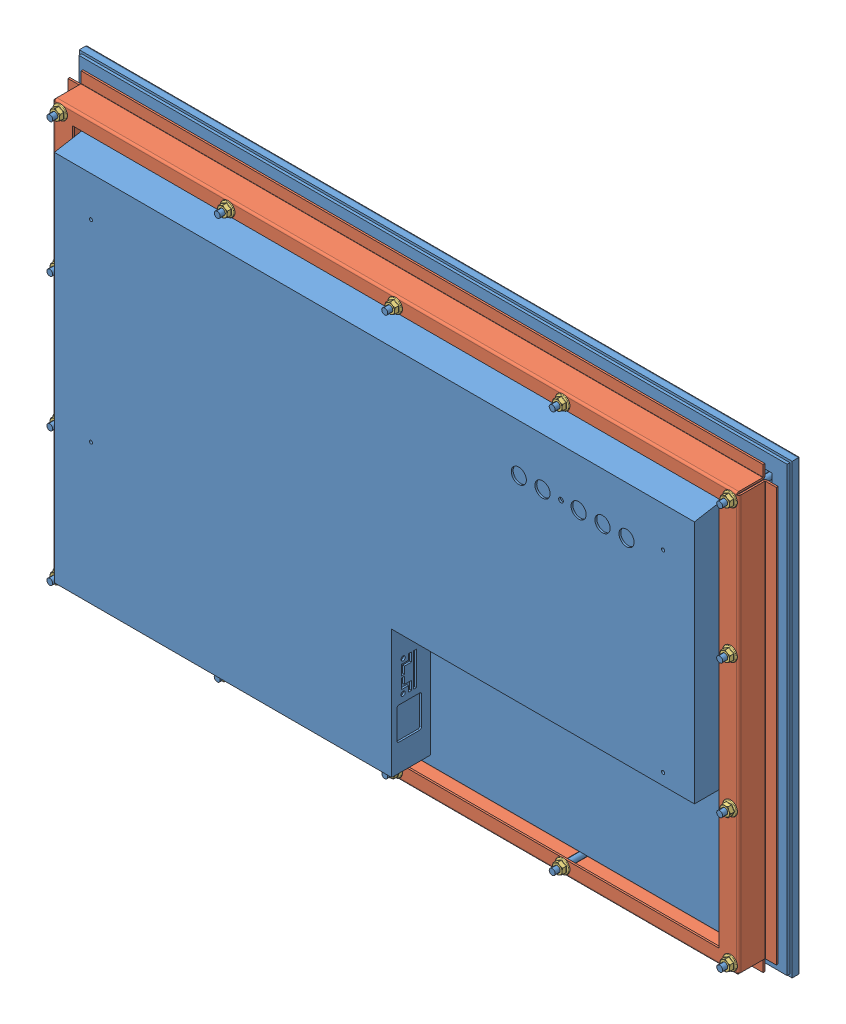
SolidWorks assembly 23 inch Panel Mount Monitor, HIS-ML23-xxxD.SLDASM, configuration Default (file format 10000). Lengths in mm.
Overall size (596.9 374.65 58.45).
16 component instances, 3 part files, 30 mates.
Components (placement in the parent):
- Monitor, 23D-2: Monitor, 23D.sldprt [Default] at origin size (596.9 374.65 58.45)
- Collar, 10914-1: Collar, 10914.sldprt [Default] at (0.0254 0 31.9305) size (593.09 368.45 23.57)
- M5 Nut, 30008-1: M5 Nut, 30008.sldprt [M5 Nut - 30008] at (-280.4668 168.1226 38.4495) size (11.8 11.8 5)
- M5 Nut, 30008-2: M5 Nut, 30008.sldprt [M5 Nut - 30008] at (-140.2334 168.1226 38.4495) x (-1 0 0) z (0 0 1) size (11.8 11.8 5)
- M5 Nut, 30008-3: M5 Nut, 30008.sldprt [M5 Nut - 30008] at (0 168.1226 38.4495) size (11.8 11.8 5)
- M5 Nut, 30008-4: M5 Nut, 30008.sldprt [M5 Nut - 30008] at (140.2334 168.1226 38.4495) size (11.8 11.8 5)
- M5 Nut, 30008-5: M5 Nut, 30008.sldprt [M5 Nut - 30008] at (280.4668 168.1226 38.4495) size (11.8 11.8 5)
- M5 Nut, 30008-6: M5 Nut, 30008.sldprt [M5 Nut - 30008] at (280.4668 56.0324 38.4495) size (11.8 11.8 5)
- M5 Nut, 30008-7: M5 Nut, 30008.sldprt [M5 Nut - 30008] at (280.4668 -56.0578 38.4495) x (0 -1 0) z (0 0 1) size (11.8 11.8 5)
- M5 Nut, 30008-8: M5 Nut, 30008.sldprt [M5 Nut - 30008] at (280.4668 -168.148 38.4495) size (11.8 11.8 5)
- M5 Nut, 30008-9: M5 Nut, 30008.sldprt [M5 Nut - 30008] at (140.2334 -168.148 38.4495) size (11.8 11.8 5)
- M5 Nut, 30008-10: M5 Nut, 30008.sldprt [M5 Nut - 30008] at (0 -168.148 38.4495) x (0.923728 -0.383049 0) z (0 0 1) size (11.8 11.8 5)
- M5 Nut, 30008-11: M5 Nut, 30008.sldprt [M5 Nut - 30008] at (-140.2334 -168.148 38.4495) size (11.8 11.8 5)
- M5 Nut, 30008-12: M5 Nut, 30008.sldprt [M5 Nut - 30008] at (-280.4668 -168.148 38.4495) size (11.8 11.8 5)
- M5 Nut, 30008-13: M5 Nut, 30008.sldprt [M5 Nut - 30008] at (-280.4668 -56.0578 38.4495) size (11.8 11.8 5)
- M5 Nut, 30008-14: M5 Nut, 30008.sldprt [M5 Nut - 30008] at (-280.4668 56.0324 38.4495) size (11.8 11.8 5)
Mates (geometry in assembly coordinates):
- Concentric1: concentric anti-aligned: cylinder of Monitor, 23D-2 through (280.4668 168.1226 42.7) axis (0 0 -1) radius 2.5; cylinder of Collar, 10914-1 through (280.4668 168.1226 33.4495) axis (0 0 1) radius 3.175
- Parallel1: parallel anti-aligned: line of Monitor, 23D-2 through (596.9 298.45 187.325) axis (0 -1 0); line of Collar, 10914-1 through (-285.4688 184.2262 11.3972) axis (1 0 0)
- Concentric21: concentric aligned: cylinder of Collar, 10914-1 through (-280.4668 168.1226 33.4495) axis (0 0 1) radius 3.175; cylinder of M5 Nut, 30008-1 through (-280.4668 168.1226 13.412) axis (0 0 1) radius 2.5
- Coincident11: coincident anti-aligned: plane of Collar, 10914-1 through (0.0254 0 33.4495) normal (0 0 1); plane of M5 Nut, 30008-1 through (-280.4668 172.7414 33.4495) normal (0 0 -1)
- Concentric31: concentric aligned: cylinder of Collar, 10914-1 through (-140.2334 168.1226 33.4495) axis (0 0 1) radius 3.175; cylinder of M5 Nut, 30008-2 through (-140.2334 168.1226 13.412) axis (0 0 1) radius 2.5
- Coincident21: coincident anti-aligned: plane of Collar, 10914-1 through (0.0254 0 33.4495) normal (0 0 1); plane of M5 Nut, 30008-2 through (-140.2334 163.5038 33.4495) normal (0 0 -1)
- Concentric41: concentric aligned: cylinder of Collar, 10914-1 through (0 168.1226 33.4495) axis (0 0 1) radius 3.175; cylinder of M5 Nut, 30008-3 through (0 168.1226 13.412) axis (0 0 1) radius 2.5
- Coincident31: coincident anti-aligned: plane of Collar, 10914-1 through (0.0254 0 33.4495) normal (0 0 1); plane of M5 Nut, 30008-3 through (0 172.7414 33.4495) normal (0 0 -1)
- Concentric51: concentric aligned: cylinder of Collar, 10914-1 through (140.2334 168.1226 33.4495) axis (0 0 1) radius 3.175; cylinder of M5 Nut, 30008-4 through (140.2334 168.1226 13.412) axis (0 0 1) radius 2.5
- Coincident41: coincident anti-aligned: plane of Collar, 10914-1 through (0.0254 0 33.4495) normal (0 0 1); plane of M5 Nut, 30008-4 through (140.2334 172.7414 33.4495) normal (0 0 -1)
- Concentric61: concentric aligned: cylinder of Collar, 10914-1 through (280.4668 168.1226 33.4495) axis (0 0 1) radius 3.175; cylinder of M5 Nut, 30008-5 through (280.4668 168.1226 13.412) axis (0 0 1) radius 2.5
- Coincident51: coincident anti-aligned: plane of Collar, 10914-1 through (0.0254 0 33.4495) normal (0 0 1); plane of M5 Nut, 30008-5 through (280.4668 172.7414 33.4495) normal (0 0 -1)
- Concentric71: concentric aligned: cylinder of Collar, 10914-1 through (280.4668 56.0324 33.4495) axis (0 0 1) radius 3.175; cylinder of M5 Nut, 30008-6 through (280.4668 56.0324 13.412) axis (0 0 1) radius 2.5
- Coincident61: coincident anti-aligned: plane of Collar, 10914-1 through (0.0254 0 33.4495) normal (0 0 1); plane of M5 Nut, 30008-6 through (280.4668 60.6512 33.4495) normal (0 0 -1)
- Concentric81: concentric aligned: cylinder of Collar, 10914-1 through (280.4668 -56.0578 33.4495) axis (0 0 1) radius 3.175; cylinder of M5 Nut, 30008-7 through (280.4668 -56.0578 13.412) axis (0 0 1) radius 2.5
- Coincident71: coincident anti-aligned: plane of Collar, 10914-1 through (0.0254 0 33.4495) normal (0 0 1); plane of M5 Nut, 30008-7 through (285.0856 -56.0578 33.4495) normal (0 0 -1)
- Concentric91: concentric aligned: cylinder of Collar, 10914-1 through (280.4668 -168.148 33.4495) axis (0 0 1) radius 3.175; cylinder of M5 Nut, 30008-8 through (280.4668 -168.148 13.412) axis (0 0 1) radius 2.5
- Coincident81: coincident anti-aligned: plane of Collar, 10914-1 through (0.0254 0 33.4495) normal (0 0 1); plane of M5 Nut, 30008-8 through (280.4668 -163.5292 33.4495) normal (0 0 -1)
- Concentric101: concentric aligned: cylinder of Collar, 10914-1 through (140.2334 -168.148 33.4495) axis (0 0 1) radius 3.175; cylinder of M5 Nut, 30008-9 through (140.2334 -168.148 13.412) axis (0 0 1) radius 2.5
- Coincident91: coincident anti-aligned: plane of Collar, 10914-1 through (0.0254 0 33.4495) normal (0 0 1); plane of M5 Nut, 30008-9 through (140.2334 -163.5292 33.4495) normal (0 0 -1)
- Concentric111: concentric aligned: cylinder of Collar, 10914-1 through (0 -168.148 33.4495) axis (0 0 1) radius 3.175; cylinder of M5 Nut, 30008-10 through (0 -168.148 13.412) axis (0 0 1) radius 2.5
- Coincident101: coincident anti-aligned: plane of Collar, 10914-1 through (0.0254 0 33.4495) normal (0 0 1); plane of M5 Nut, 30008-10 through (1.7692 -163.8815 33.4495) normal (0 0 -1)
- Concentric121: concentric aligned: cylinder of Collar, 10914-1 through (-140.2334 -168.148 33.4495) axis (0 0 1) radius 3.175; cylinder of M5 Nut, 30008-11 through (-140.2334 -168.148 13.412) axis (0 0 1) radius 2.5
- Coincident111: coincident anti-aligned: plane of Collar, 10914-1 through (0.0254 0 33.4495) normal (0 0 1); plane of M5 Nut, 30008-11 through (-140.2334 -163.5292 33.4495) normal (0 0 -1)
- Concentric131: concentric aligned: cylinder of Collar, 10914-1 through (-280.4668 -168.148 33.4495) axis (0 0 1) radius 3.175; cylinder of M5 Nut, 30008-12 through (-280.4668 -168.148 13.412) axis (0 0 1) radius 2.5
- Coincident121: coincident anti-aligned: plane of Collar, 10914-1 through (0.0254 0 33.4495) normal (0 0 1); plane of M5 Nut, 30008-12 through (-280.4668 -163.5292 33.4495) normal (0 0 -1)
- Concentric141: concentric aligned: cylinder of Collar, 10914-1 through (-280.4668 -56.0578 33.4495) axis (0 0 1) radius 3.175; cylinder of M5 Nut, 30008-13 through (-280.4668 -56.0578 13.412) axis (0 0 1) radius 2.5
- Coincident131: coincident anti-aligned: plane of Collar, 10914-1 through (0.0254 0 33.4495) normal (0 0 1); plane of M5 Nut, 30008-13 through (-280.4668 -51.439 33.4495) normal (0 0 -1)
- Concentric151: concentric aligned: cylinder of Collar, 10914-1 through (-280.4668 56.0324 33.4495) axis (0 0 1) radius 3.175; cylinder of M5 Nut, 30008-14 through (-280.4668 56.0324 13.412) axis (0 0 1) radius 2.5
- Coincident141: coincident anti-aligned: plane of Collar, 10914-1 through (0.0254 0 33.4495) normal (0 0 1); plane of M5 Nut, 30008-14 through (-280.4668 60.6512 33.4495) normal (0 0 -1)
